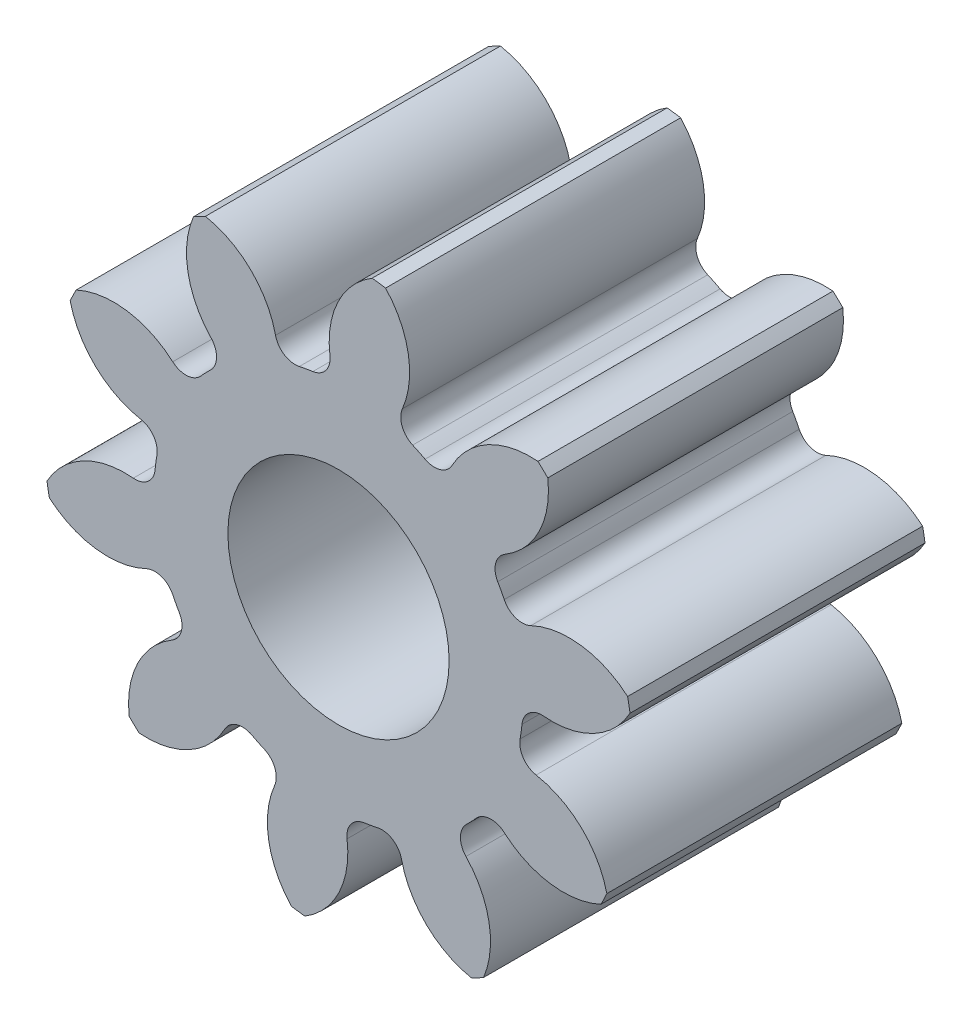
from build123d import *

# Parameters (mm, degrees)
SKETCH3_R         = 101.6
GEARBODY_DEPTH    = 101.6
TOOTHCUT_DEPTH    = 176.976362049
CIRPATTERN1_COUNT = 10
BOREDIA_R         = 38.1
BORE_DEPTH        = 12700


with BuildPart() as part:
    # Sketch3 → gearBody (new body)
    with BuildSketch(Plane.XY):
        Circle(SKETCH3_R)
    extrude(amount=GEARBODY_DEPTH)

    # Sketch2 → toothCut (cut, through all)
    with BuildSketch(Plane.XY):
        with BuildLine():
            ThreePointArc((62.53326341, -11.038159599), (62.902142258, -8.693129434), (63.183112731, -6.335950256))
            ThreePointArc((63.183112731, -6.335950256), (65.657192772, -1.705371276), (70.674988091, -0.161006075))
            ThreePointArc((70.674988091, -0.161006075), (89.055929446, 3.932785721), (101.6, 17.977871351))
            ThreePointArc((101.6, 17.977871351), (102.206878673, -14.125077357), (92.915737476, -44.86011132))
            ThreePointArc((92.915737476, -44.86011132), (84.651186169, -27.939256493), (68.069542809, -19.013605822))
            ThreePointArc((68.069542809, -19.013605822), (63.658694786, -16.166194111), (62.53326341, -11.038159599))
        make_face()
    toothcut = extrude(amount=TOOTHCUT_DEPTH, mode=Mode.SUBTRACT)

    # CirPattern1: toothCut ×10 about axis
    cirpattern1_axis = Axis((0, 0, 0), (0, 0, 1))
    for i in range(1, CIRPATTERN1_COUNT):
        add(toothcut.rotate(cirpattern1_axis, i * 360 / CIRPATTERN1_COUNT), mode=Mode.SUBTRACT)

    # boreDia → bore (cut, symmetric)
    with BuildSketch(Plane.XY):
        Circle(BOREDIA_R)
    extrude(amount=BORE_DEPTH, both=True, mode=Mode.SUBTRACT)


solid = part.part
